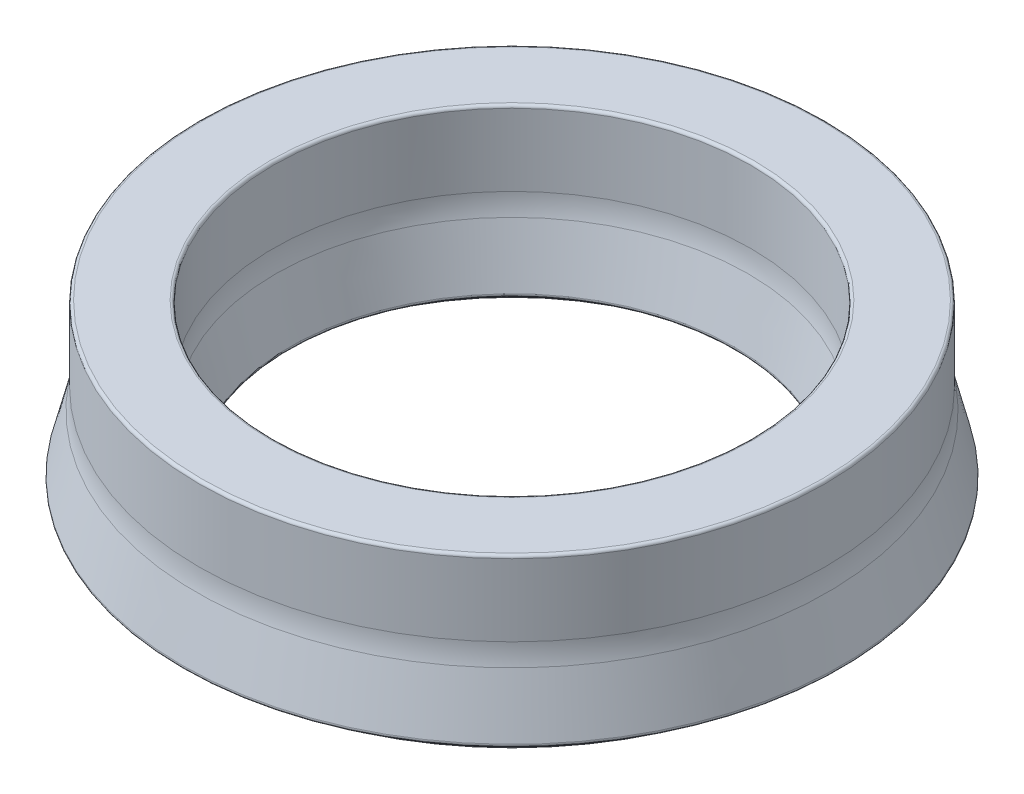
from build123d import *

# Parameters (mm, degrees)
FILLET1_R = 0.9525
FILLET2_R = 0.03175


with BuildPart() as part:
    # Sketch1 → Revolve1 (revolve)
    with BuildSketch(Plane.XY, mode=Mode.PRIVATE) as revolve1_sk:
        Polygon((3.429, 0), (3.302, 0), (3.302, 1.397), (2.8575, 1.397), (2.8575, 0), (2.7305, 0), (2.4765, 0.1905), (2.667, 0.9525), (2.667, 1.905), (3.4925, 1.905), (3.4925, 0.9525), (3.683, 0.1905), align=None)
    revolve(revolve1_sk.sketch.rotate(Axis((0, 0, 0), (0, 1, 0)), 90), axis=Axis((0, 0, 0), (0, 1, 0)))

    # Fillet1
    fillet1_edges = [part.edges().sort_by_distance(p)[0] for p in [
        (0, 0.9525, 2.667),
        (0, 0.9525, 3.4925),
    ]]
    fillet(fillet1_edges, radius=FILLET1_R)

    # Fillet2
    fillet2_edges = [part.edges().sort_by_distance(p)[0] for p in [
        (0, 0, 3.429),
        (0, 0, 3.302),
        (0, 1.397, 3.302),
        (0, 1.397, 2.8575),
        (0, 0, 2.8575),
        (0, 0, 2.7305),
        (0, 0.1905, 2.4765),
        (0, 1.905, 2.667),
        (0, 1.905, 3.4925),
        (0, 0.1905, 3.683),
    ]]
    fillet(fillet2_edges, radius=FILLET2_R)


solid = part.part
